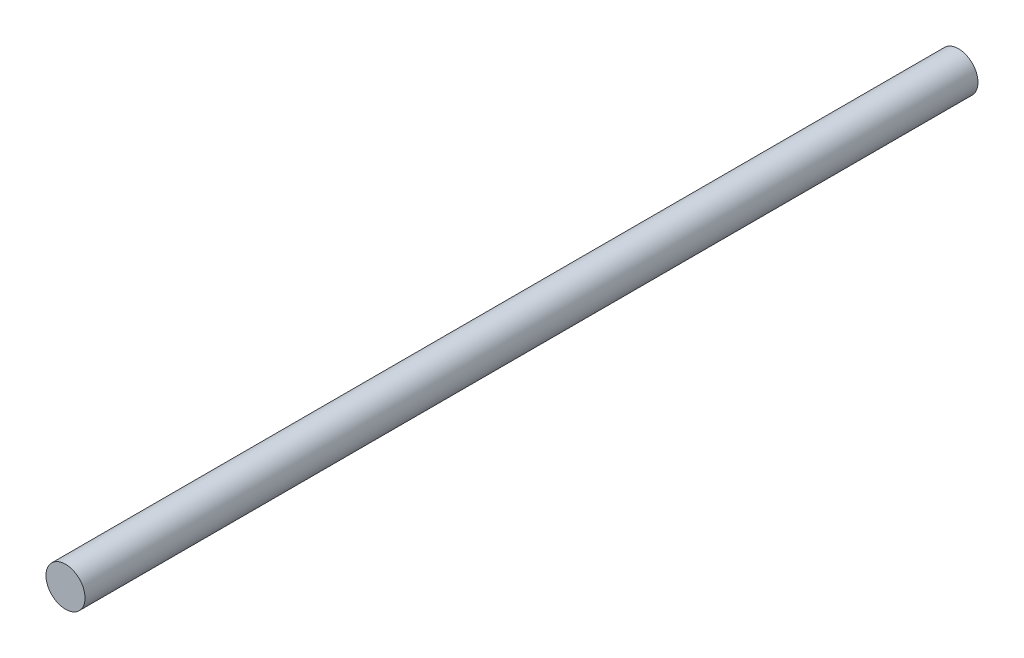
from build123d import *

# Parameters (mm, degrees)
SKETCH1_R           = 5
BOSS_EXTRUDE1_DEPTH = 228.6


with BuildPart() as part:
    # Sketch1 → Boss-Extrude1 (new body)
    with BuildSketch(Plane.XY):
        Circle(SKETCH1_R)
    extrude(amount=BOSS_EXTRUDE1_DEPTH)


solid = part.part
